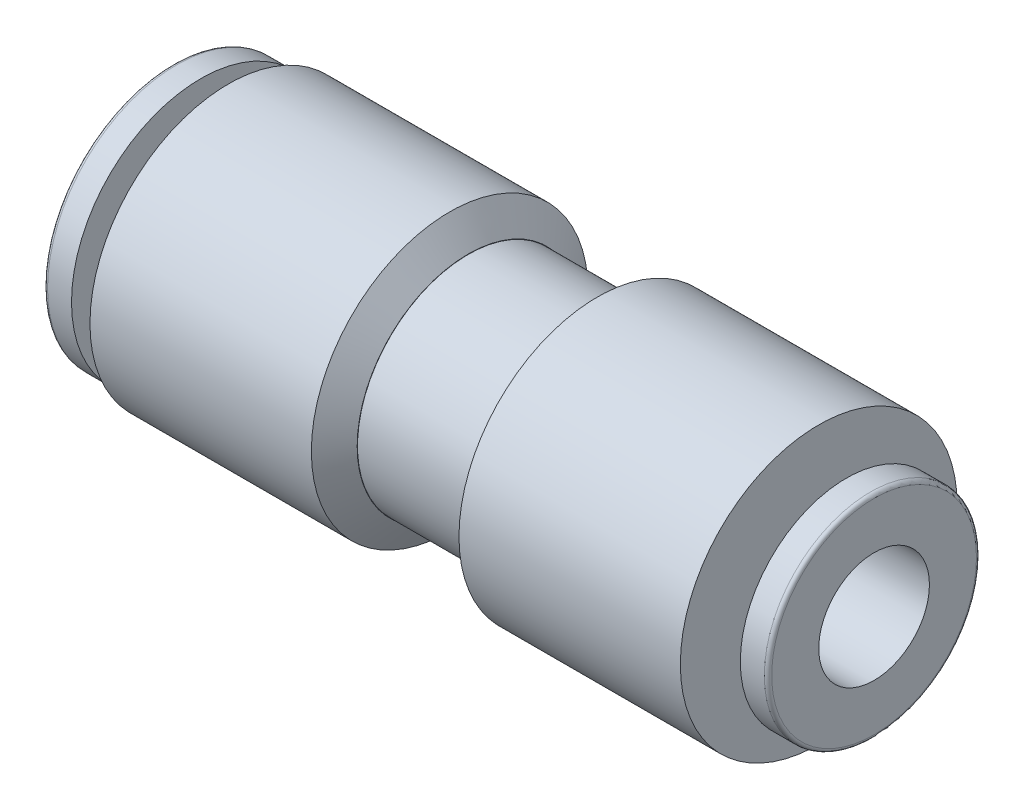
ISO-10303-21;
HEADER;
FILE_DESCRIPTION(('STEP AP214'),'2;1');
FILE_NAME('part.step','',(''),(''),'','','');
FILE_SCHEMA(('AUTOMOTIVE_DESIGN { 1 0 10303 214 1 1 1 1 }'));
ENDSEC;
DATA;
#1=APPLICATION_CONTEXT('core data for automotive mechanical design processes');
#2=APPLICATION_PROTOCOL_DEFINITION('international standard','automotive_design',2000,#1);
#3=PRODUCT_CONTEXT('',#1,'mechanical');
#4=PRODUCT('Part','Part','',(#3));
#5=PRODUCT_RELATED_PRODUCT_CATEGORY('part','',(#4));
#6=PRODUCT_DEFINITION_FORMATION('','',#4);
#7=PRODUCT_DEFINITION_CONTEXT('part definition',#1,'design');
#8=PRODUCT_DEFINITION('design','',#6,#7);
#9=PRODUCT_DEFINITION_SHAPE('','',#8);
#10=(LENGTH_UNIT() NAMED_UNIT(*) SI_UNIT(.MILLI.,.METRE.));
#11=(NAMED_UNIT(*) PLANE_ANGLE_UNIT() SI_UNIT($,.RADIAN.));
#12=(NAMED_UNIT(*) SI_UNIT($,.STERADIAN.) SOLID_ANGLE_UNIT());
#13=UNCERTAINTY_MEASURE_WITH_UNIT(LENGTH_MEASURE(1.E-05),#10,'distance_accuracy_value','');
#14=(GEOMETRIC_REPRESENTATION_CONTEXT(3) GLOBAL_UNCERTAINTY_ASSIGNED_CONTEXT((#13)) GLOBAL_UNIT_ASSIGNED_CONTEXT((#10,
#11,#12)) REPRESENTATION_CONTEXT('',''));
#15=CARTESIAN_POINT('',(0.,0.,0.));
#16=DIRECTION('',(0.,0.,1.));
#17=DIRECTION('',(1.,0.,0.));
#18=AXIS2_PLACEMENT_3D('',#15,#16,#17);
#19=CARTESIAN_POINT('',(0.,0.,0.));
#20=DIRECTION('',(1.,0.,0.));
#21=DIRECTION('',(0.,0.,-1.));
#22=AXIS2_PLACEMENT_3D('',#19,#20,#21);
#23=PLANE('',#22);
#24=CARTESIAN_POINT('',(0.,0.,0.));
#25=DIRECTION('',(1.,0.,0.));
#26=DIRECTION('',(0.,0.,-1.));
#27=AXIS2_PLACEMENT_3D('',#24,#25,#26);
#28=CIRCLE('',#27,7.5);
#29=CARTESIAN_POINT('',(0.,0.,7.5));
#30=VERTEX_POINT('',#29);
#31=EDGE_CURVE('E64',#30,#30,#28,.T.);
#32=ORIENTED_EDGE('',*,*,#31,.F.);
#33=EDGE_LOOP('',(#32));
#34=FACE_BOUND('',#33,.T.);
#35=CARTESIAN_POINT('',(0.,0.,0.));
#36=DIRECTION('',(1.,0.,0.));
#37=DIRECTION('',(0.,0.,-1.));
#38=AXIS2_PLACEMENT_3D('',#35,#36,#37);
#39=CIRCLE('',#38,4.5);
#40=CARTESIAN_POINT('',(0.,0.,-4.5));
#41=VERTEX_POINT('',#40);
#42=EDGE_CURVE('E61',#41,#41,#39,.F.);
#43=ORIENTED_EDGE('',*,*,#42,.F.);
#44=EDGE_LOOP('',(#43));
#45=FACE_BOUND('',#44,.T.);
#46=ADVANCED_FACE('F29',(#34,#45),#23,.F.);
#47=CARTESIAN_POINT('',(32.,0.,0.));
#48=DIRECTION('',(1.,0.,0.));
#49=DIRECTION('',(0.,0.,-1.));
#50=AXIS2_PLACEMENT_3D('',#47,#48,#49);
#51=PLANE('',#50);
#52=CARTESIAN_POINT('',(32.,0.,0.));
#53=DIRECTION('',(1.,0.,0.));
#54=DIRECTION('',(0.,0.,-1.));
#55=AXIS2_PLACEMENT_3D('',#52,#53,#54);
#56=CIRCLE('',#55,7.5);
#57=CARTESIAN_POINT('',(32.,0.,7.5));
#58=VERTEX_POINT('',#57);
#59=EDGE_CURVE('E71',#58,#58,#56,.T.);
#60=ORIENTED_EDGE('',*,*,#59,.T.);
#61=EDGE_LOOP('',(#60));
#62=FACE_BOUND('',#61,.T.);
#63=CARTESIAN_POINT('',(32.,0.,0.));
#64=DIRECTION('',(1.,0.,0.));
#65=DIRECTION('',(0.,0.,-1.));
#66=AXIS2_PLACEMENT_3D('',#63,#64,#65);
#67=CIRCLE('',#66,3.5);
#68=CARTESIAN_POINT('',(32.,0.,-3.5));
#69=VERTEX_POINT('',#68);
#70=EDGE_CURVE('E77',#69,#69,#67,.T.);
#71=ORIENTED_EDGE('',*,*,#70,.F.);
#72=EDGE_LOOP('',(#71));
#73=FACE_BOUND('',#72,.T.);
#74=ADVANCED_FACE('F129',(#62,#73),#51,.T.);
#75=CARTESIAN_POINT('',(13.,0.,0.));
#76=DIRECTION('',(1.,0.,0.));
#77=DIRECTION('',(0.,0.,-1.));
#78=AXIS2_PLACEMENT_3D('',#75,#76,#77);
#79=PLANE('',#78);
#80=CARTESIAN_POINT('',(13.,0.,0.));
#81=DIRECTION('',(1.,0.,0.));
#82=DIRECTION('',(0.,0.,-1.));
#83=AXIS2_PLACEMENT_3D('',#80,#81,#82);
#84=CIRCLE('',#83,6.01743903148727);
#85=CARTESIAN_POINT('',(13.,0.,-6.01743903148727));
#86=VERTEX_POINT('',#85);
#87=EDGE_CURVE('E58',#86,#86,#84,.T.);
#88=ORIENTED_EDGE('',*,*,#87,.T.);
#89=EDGE_LOOP('',(#88));
#90=FACE_BOUND('',#89,.T.);
#91=CARTESIAN_POINT('',(13.,0.,0.));
#92=DIRECTION('',(1.,0.,0.));
#93=DIRECTION('',(0.,0.,-1.));
#94=AXIS2_PLACEMENT_3D('',#91,#92,#93);
#95=CIRCLE('',#94,6.);
#96=CARTESIAN_POINT('',(13.,0.,-6.));
#97=VERTEX_POINT('',#96);
#98=EDGE_CURVE('E68',#97,#97,#95,.T.);
#99=ORIENTED_EDGE('',*,*,#98,.F.);
#100=EDGE_LOOP('',(#99));
#101=FACE_BOUND('',#100,.T.);
#102=ADVANCED_FACE('F135',(#90,#101),#79,.T.);
#103=CARTESIAN_POINT('',(13.,0.,0.));
#104=DIRECTION('',(-1.,0.,0.));
#105=DIRECTION('',(0.,0.,1.));
#106=AXIS2_PLACEMENT_3D('',#103,#104,#105);
#107=CYLINDRICAL_SURFACE('',#106,7.5);
#108=CARTESIAN_POINT('',(12.,0.,0.));
#109=DIRECTION('',(1.,0.,0.));
#110=DIRECTION('',(0.,0.,-1.));
#111=AXIS2_PLACEMENT_3D('',#108,#109,#110);
#112=CIRCLE('',#111,7.5);
#113=CARTESIAN_POINT('',(12.,0.,7.5));
#114=VERTEX_POINT('',#113);
#115=EDGE_CURVE('E55',#114,#114,#112,.F.);
#116=CARTESIAN_POINT('',(12.,0.,7.5));
#117=CARTESIAN_POINT('',(11.875,0.,7.5));
#118=CARTESIAN_POINT('',(11.75,0.,7.5));
#119=CARTESIAN_POINT('',(11.5,0.,7.5));
#120=CARTESIAN_POINT('',(11.375,0.,7.5));
#121=CARTESIAN_POINT('',(11.125,0.,7.5));
#122=CARTESIAN_POINT('',(11.,0.,7.5));
#123=CARTESIAN_POINT('',(10.75,0.,7.5));
#124=CARTESIAN_POINT('',(10.625,0.,7.5));
#125=CARTESIAN_POINT('',(10.375,0.,7.5));
#126=CARTESIAN_POINT('',(10.25,0.,7.5));
#127=CARTESIAN_POINT('',(10.,0.,7.5));
#128=CARTESIAN_POINT('',(9.875,0.,7.5));
#129=CARTESIAN_POINT('',(9.625,0.,7.5));
#130=CARTESIAN_POINT('',(9.5,0.,7.5));
#131=CARTESIAN_POINT('',(9.25,0.,7.5));
#132=CARTESIAN_POINT('',(9.12500000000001,0.,7.5));
#133=CARTESIAN_POINT('',(8.875,0.,7.5));
#134=CARTESIAN_POINT('',(8.75,0.,7.5));
#135=CARTESIAN_POINT('',(8.5,0.,7.5));
#136=CARTESIAN_POINT('',(8.375,0.,7.5));
#137=CARTESIAN_POINT('',(8.125,0.,7.5));
#138=CARTESIAN_POINT('',(8.,0.,7.5));
#139=CARTESIAN_POINT('',(7.75,0.,7.5));
#140=CARTESIAN_POINT('',(7.625,0.,7.5));
#141=CARTESIAN_POINT('',(7.375,0.,7.5));
#142=CARTESIAN_POINT('',(7.25,0.,7.5));
#143=CARTESIAN_POINT('',(7.,0.,7.5));
#144=CARTESIAN_POINT('',(6.875,0.,7.5));
#145=CARTESIAN_POINT('',(6.625,0.,7.5));
#146=CARTESIAN_POINT('',(6.5,0.,7.5));
#147=CARTESIAN_POINT('',(6.25,0.,7.5));
#148=CARTESIAN_POINT('',(6.125,0.,7.5));
#149=CARTESIAN_POINT('',(5.875,0.,7.5));
#150=CARTESIAN_POINT('',(5.75,0.,7.5));
#151=CARTESIAN_POINT('',(5.5,0.,7.5));
#152=CARTESIAN_POINT('',(5.375,0.,7.5));
#153=CARTESIAN_POINT('',(5.125,0.,7.5));
#154=CARTESIAN_POINT('',(5.,0.,7.5));
#155=CARTESIAN_POINT('',(4.75,0.,7.5));
#156=CARTESIAN_POINT('',(4.625,0.,7.5));
#157=CARTESIAN_POINT('',(4.375,0.,7.5));
#158=CARTESIAN_POINT('',(4.25,0.,7.5));
#159=CARTESIAN_POINT('',(4.,0.,7.5));
#160=CARTESIAN_POINT('',(3.875,0.,7.5));
#161=CARTESIAN_POINT('',(3.625,0.,7.5));
#162=CARTESIAN_POINT('',(3.5,0.,7.5));
#163=CARTESIAN_POINT('',(3.25,0.,7.5));
#164=CARTESIAN_POINT('',(3.125,0.,7.5));
#165=CARTESIAN_POINT('',(2.875,0.,7.5));
#166=CARTESIAN_POINT('',(2.75,0.,7.5));
#167=CARTESIAN_POINT('',(2.5,0.,7.5));
#168=CARTESIAN_POINT('',(2.375,0.,7.5));
#169=CARTESIAN_POINT('',(2.125,0.,7.5));
#170=CARTESIAN_POINT('',(2.,0.,7.5));
#171=CARTESIAN_POINT('',(1.75,0.,7.5));
#172=CARTESIAN_POINT('',(1.625,0.,7.5));
#173=CARTESIAN_POINT('',(1.375,0.,7.5));
#174=CARTESIAN_POINT('',(1.25,0.,7.5));
#175=CARTESIAN_POINT('',(1.,0.,7.5));
#176=CARTESIAN_POINT('',(0.875000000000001,0.,7.5));
#177=CARTESIAN_POINT('',(0.625000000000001,0.,7.5));
#178=CARTESIAN_POINT('',(0.5,0.,7.5));
#179=CARTESIAN_POINT('',(0.25,0.,7.5));
#180=CARTESIAN_POINT('',(0.125,0.,7.5));
#181=CARTESIAN_POINT('',(0.,0.,7.5));
#182=B_SPLINE_CURVE_WITH_KNOTS('',3,(#116,#117,#118,#119,#120,#121,#122,#123,#124,#125,#126,
#127,#128,#129,#130,#131,#132,#133,#134,#135,#136,#137,#138,#139,#140,#141,#142,#143,#144,#145,
#146,#147,#148,#149,#150,#151,#152,#153,#154,#155,#156,#157,#158,#159,#160,#161,#162,#163,#164,
#165,#166,#167,#168,#169,#170,#171,#172,#173,#174,#175,#176,#177,#178,#179,#180,#181),
.UNSPECIFIED.,.F.,.F.,(4,2,2,2,2,2,2,2,2,2,2,2,2,2,2,2,2,2,2,2,2,2,2,2,2,2,2,2,2,2,2,2,4),(0.,
0.375,0.750000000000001,1.125,1.5,1.875,2.25,2.625,3.,3.375,3.75,4.125,4.5,4.875,5.25,5.625,6.,
6.375,6.75,7.125,7.50000000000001,7.87500000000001,8.25000000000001,8.62500000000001,9.,9.375,
9.75,10.125,10.5,10.875,11.25,11.625,12.),.UNSPECIFIED.);
#183=EDGE_CURVE('BSEAM143',#114,#30,#182,.T.);
#184=ORIENTED_EDGE('',*,*,#115,.T.);
#185=ORIENTED_EDGE('',*,*,#31,.T.);
#186=ORIENTED_EDGE('',*,*,#183,.T.);
#187=ORIENTED_EDGE('',*,*,#183,.F.);
#188=EDGE_LOOP('',(#184,#186,#185,#187));
#189=FACE_BOUND('',#188,.T.);
#190=ADVANCED_FACE('F143',(#189),#107,.T.);
#191=CARTESIAN_POINT('',(19.,0.,0.));
#192=DIRECTION('',(-1.,0.,0.));
#193=DIRECTION('',(0.,0.,1.));
#194=AXIS2_PLACEMENT_3D('',#191,#192,#193);
#195=CYLINDRICAL_SURFACE('',#194,6.);
#196=CARTESIAN_POINT('',(19.,0.,0.));
#197=DIRECTION('',(1.,0.,0.));
#198=DIRECTION('',(0.,0.,-1.));
#199=AXIS2_PLACEMENT_3D('',#196,#197,#198);
#200=CIRCLE('',#199,6.);
#201=CARTESIAN_POINT('',(19.,0.,-6.));
#202=VERTEX_POINT('',#201);
#203=EDGE_CURVE('E67',#202,#202,#200,.T.);
#204=ORIENTED_EDGE('',*,*,#203,.F.);
#205=EDGE_LOOP('',(#204));
#206=FACE_BOUND('',#205,.T.);
#207=ORIENTED_EDGE('',*,*,#98,.T.);
#208=EDGE_LOOP('',(#207));
#209=FACE_BOUND('',#208,.T.);
#210=ADVANCED_FACE('F146',(#206,#209),#195,.T.);
#211=CARTESIAN_POINT('',(19.,0.,0.));
#212=DIRECTION('',(1.,0.,0.));
#213=DIRECTION('',(0.,0.,-1.));
#214=AXIS2_PLACEMENT_3D('',#211,#212,#213);
#215=PLANE('',#214);
#216=CARTESIAN_POINT('',(19.,0.,0.));
#217=DIRECTION('',(1.,0.,0.));
#218=DIRECTION('',(0.,0.,-1.));
#219=AXIS2_PLACEMENT_3D('',#216,#217,#218);
#220=CIRCLE('',#219,6.01743903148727);
#221=CARTESIAN_POINT('',(19.,0.,-6.01743903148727));
#222=VERTEX_POINT('',#221);
#223=EDGE_CURVE('E49',#222,#222,#220,.F.);
#224=ORIENTED_EDGE('',*,*,#223,.T.);
#225=EDGE_LOOP('',(#224));
#226=FACE_BOUND('',#225,.T.);
#227=ORIENTED_EDGE('',*,*,#203,.T.);
#228=EDGE_LOOP('',(#227));
#229=FACE_BOUND('',#228,.T.);
#230=ADVANCED_FACE('F191',(#226,#229),#215,.F.);
#231=CARTESIAN_POINT('',(32.,0.,0.));
#232=DIRECTION('',(-1.,0.,0.));
#233=DIRECTION('',(0.,0.,1.));
#234=AXIS2_PLACEMENT_3D('',#231,#232,#233);
#235=CYLINDRICAL_SURFACE('',#234,7.5);
#236=CARTESIAN_POINT('',(20.,0.,0.));
#237=DIRECTION('',(1.,0.,0.));
#238=DIRECTION('',(0.,0.,-1.));
#239=AXIS2_PLACEMENT_3D('',#236,#237,#238);
#240=CIRCLE('',#239,7.5);
#241=CARTESIAN_POINT('',(20.,0.,7.5));
#242=VERTEX_POINT('',#241);
#243=EDGE_CURVE('E52',#242,#242,#240,.T.);
#244=CARTESIAN_POINT('',(20.,0.,7.5));
#245=CARTESIAN_POINT('',(20.125,0.,7.5));
#246=CARTESIAN_POINT('',(20.25,0.,7.5));
#247=CARTESIAN_POINT('',(20.5,0.,7.5));
#248=CARTESIAN_POINT('',(20.625,0.,7.5));
#249=CARTESIAN_POINT('',(20.875,0.,7.5));
#250=CARTESIAN_POINT('',(21.,0.,7.5));
#251=CARTESIAN_POINT('',(21.25,0.,7.5));
#252=CARTESIAN_POINT('',(21.375,0.,7.5));
#253=CARTESIAN_POINT('',(21.625,0.,7.5));
#254=CARTESIAN_POINT('',(21.75,0.,7.5));
#255=CARTESIAN_POINT('',(22.,0.,7.5));
#256=CARTESIAN_POINT('',(22.125,0.,7.5));
#257=CARTESIAN_POINT('',(22.375,0.,7.5));
#258=CARTESIAN_POINT('',(22.5,0.,7.5));
#259=CARTESIAN_POINT('',(22.75,0.,7.5));
#260=CARTESIAN_POINT('',(22.875,0.,7.5));
#261=CARTESIAN_POINT('',(23.125,0.,7.5));
#262=CARTESIAN_POINT('',(23.25,0.,7.5));
#263=CARTESIAN_POINT('',(23.5,0.,7.5));
#264=CARTESIAN_POINT('',(23.625,0.,7.5));
#265=CARTESIAN_POINT('',(23.875,0.,7.5));
#266=CARTESIAN_POINT('',(24.,0.,7.5));
#267=CARTESIAN_POINT('',(24.25,0.,7.5));
#268=CARTESIAN_POINT('',(24.375,0.,7.5));
#269=CARTESIAN_POINT('',(24.625,0.,7.5));
#270=CARTESIAN_POINT('',(24.75,0.,7.5));
#271=CARTESIAN_POINT('',(25.,0.,7.5));
#272=CARTESIAN_POINT('',(25.125,0.,7.5));
#273=CARTESIAN_POINT('',(25.375,0.,7.5));
#274=CARTESIAN_POINT('',(25.5,0.,7.5));
#275=CARTESIAN_POINT('',(25.75,0.,7.5));
#276=CARTESIAN_POINT('',(25.875,0.,7.5));
#277=CARTESIAN_POINT('',(26.125,0.,7.5));
#278=CARTESIAN_POINT('',(26.25,0.,7.5));
#279=CARTESIAN_POINT('',(26.5,0.,7.5));
#280=CARTESIAN_POINT('',(26.625,0.,7.5));
#281=CARTESIAN_POINT('',(26.875,0.,7.5));
#282=CARTESIAN_POINT('',(27.,0.,7.5));
#283=CARTESIAN_POINT('',(27.25,0.,7.5));
#284=CARTESIAN_POINT('',(27.375,0.,7.5));
#285=CARTESIAN_POINT('',(27.625,0.,7.5));
#286=CARTESIAN_POINT('',(27.75,0.,7.5));
#287=CARTESIAN_POINT('',(28.,0.,7.5));
#288=CARTESIAN_POINT('',(28.125,0.,7.5));
#289=CARTESIAN_POINT('',(28.375,0.,7.5));
#290=CARTESIAN_POINT('',(28.5,0.,7.5));
#291=CARTESIAN_POINT('',(28.75,0.,7.5));
#292=CARTESIAN_POINT('',(28.875,0.,7.5));
#293=CARTESIAN_POINT('',(29.125,0.,7.5));
#294=CARTESIAN_POINT('',(29.25,0.,7.5));
#295=CARTESIAN_POINT('',(29.5,0.,7.5));
#296=CARTESIAN_POINT('',(29.625,0.,7.5));
#297=CARTESIAN_POINT('',(29.875,0.,7.5));
#298=CARTESIAN_POINT('',(30.,0.,7.5));
#299=CARTESIAN_POINT('',(30.25,0.,7.5));
#300=CARTESIAN_POINT('',(30.375,0.,7.5));
#301=CARTESIAN_POINT('',(30.625,0.,7.5));
#302=CARTESIAN_POINT('',(30.75,0.,7.5));
#303=CARTESIAN_POINT('',(31.,0.,7.5));
#304=CARTESIAN_POINT('',(31.125,0.,7.5));
#305=CARTESIAN_POINT('',(31.375,0.,7.5));
#306=CARTESIAN_POINT('',(31.5,0.,7.5));
#307=CARTESIAN_POINT('',(31.75,0.,7.5));
#308=CARTESIAN_POINT('',(31.875,0.,7.5));
#309=CARTESIAN_POINT('',(32.,0.,7.5));
#310=B_SPLINE_CURVE_WITH_KNOTS('',3,(#244,#245,#246,#247,#248,#249,#250,#251,#252,#253,#254,
#255,#256,#257,#258,#259,#260,#261,#262,#263,#264,#265,#266,#267,#268,#269,#270,#271,#272,#273,
#274,#275,#276,#277,#278,#279,#280,#281,#282,#283,#284,#285,#286,#287,#288,#289,#290,#291,#292,
#293,#294,#295,#296,#297,#298,#299,#300,#301,#302,#303,#304,#305,#306,#307,#308,#309),
.UNSPECIFIED.,.F.,.F.,(4,2,2,2,2,2,2,2,2,2,2,2,2,2,2,2,2,2,2,2,2,2,2,2,2,2,2,2,2,2,2,2,4),(0.,
0.375,0.750000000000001,1.125,1.5,1.875,2.25,2.625,3.,3.375,3.75,4.125,4.5,4.875,5.25,5.625,6.,
6.375,6.75,7.125,7.5,7.875,8.25,8.625,9.00000000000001,9.37500000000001,9.75000000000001,10.125,
10.5,10.875,11.25,11.625,12.),.UNSPECIFIED.);
#311=EDGE_CURVE('BSEAM188',#242,#58,#310,.T.);
#312=ORIENTED_EDGE('',*,*,#243,.T.);
#313=ORIENTED_EDGE('',*,*,#59,.F.);
#314=ORIENTED_EDGE('',*,*,#311,.T.);
#315=ORIENTED_EDGE('',*,*,#311,.F.);
#316=EDGE_LOOP('',(#312,#314,#313,#315));
#317=FACE_BOUND('',#316,.T.);
#318=ADVANCED_FACE('F188',(#317),#235,.T.);
#319=CARTESIAN_POINT('',(33.5,0.,0.));
#320=DIRECTION('',(-1.,0.,0.));
#321=DIRECTION('',(0.,0.,1.));
#322=AXIS2_PLACEMENT_3D('',#319,#320,#321);
#323=CYLINDRICAL_SURFACE('',#322,3.5);
#324=CARTESIAN_POINT('',(33.5,0.,0.));
#325=DIRECTION('',(1.,0.,0.));
#326=DIRECTION('',(0.,0.,-1.));
#327=AXIS2_PLACEMENT_3D('',#324,#325,#326);
#328=CIRCLE('',#327,3.5);
#329=CARTESIAN_POINT('',(33.5,0.,-3.5));
#330=VERTEX_POINT('',#329);
#331=EDGE_CURVE('E76',#330,#330,#328,.T.);
#332=ORIENTED_EDGE('',*,*,#331,.F.);
#333=EDGE_LOOP('',(#332));
#334=FACE_BOUND('',#333,.T.);
#335=ORIENTED_EDGE('',*,*,#70,.T.);
#336=EDGE_LOOP('',(#335));
#337=FACE_BOUND('',#336,.T.);
#338=ADVANCED_FACE('F184',(#334,#337),#323,.T.);
#339=CARTESIAN_POINT('',(33.5,0.,0.));
#340=DIRECTION('',(1.,0.,0.));
#341=DIRECTION('',(0.,0.,-1.));
#342=AXIS2_PLACEMENT_3D('',#339,#340,#341);
#343=PLANE('',#342);
#344=CARTESIAN_POINT('',(33.5,0.,0.));
#345=DIRECTION('',(1.,0.,0.));
#346=DIRECTION('',(0.,0.,-1.));
#347=AXIS2_PLACEMENT_3D('',#344,#345,#346);
#348=CIRCLE('',#347,5.75);
#349=CARTESIAN_POINT('',(33.5,0.,-5.75));
#350=VERTEX_POINT('',#349);
#351=EDGE_CURVE('E80',#350,#350,#348,.T.);
#352=ORIENTED_EDGE('',*,*,#351,.F.);
#353=EDGE_LOOP('',(#352));
#354=FACE_BOUND('',#353,.T.);
#355=ORIENTED_EDGE('',*,*,#331,.T.);
#356=EDGE_LOOP('',(#355));
#357=FACE_BOUND('',#356,.T.);
#358=ADVANCED_FACE('F179',(#354,#357),#343,.F.);
#359=CARTESIAN_POINT('',(35.,0.,0.));
#360=DIRECTION('',(-1.,0.,0.));
#361=DIRECTION('',(0.,0.,1.));
#362=AXIS2_PLACEMENT_3D('',#359,#360,#361);
#363=CYLINDRICAL_SURFACE('',#362,5.75);
#364=CARTESIAN_POINT('',(34.8,0.,0.));
#365=DIRECTION('',(1.,0.,0.));
#366=DIRECTION('',(0.,0.,-1.));
#367=AXIS2_PLACEMENT_3D('',#364,#365,#366);
#368=CIRCLE('',#367,5.75);
#369=CARTESIAN_POINT('',(34.8,0.,-5.75));
#370=VERTEX_POINT('',#369);
#371=EDGE_CURVE('E40',#370,#370,#368,.F.);
#372=ORIENTED_EDGE('',*,*,#371,.T.);
#373=EDGE_LOOP('',(#372));
#374=FACE_BOUND('',#373,.T.);
#375=ORIENTED_EDGE('',*,*,#351,.T.);
#376=EDGE_LOOP('',(#375));
#377=FACE_BOUND('',#376,.T.);
#378=ADVANCED_FACE('F169',(#374,#377),#363,.T.);
#379=CARTESIAN_POINT('',(35.,0.,0.));
#380=DIRECTION('',(1.,0.,0.));
#381=DIRECTION('',(0.,0.,-1.));
#382=AXIS2_PLACEMENT_3D('',#379,#380,#381);
#383=PLANE('',#382);
#384=CARTESIAN_POINT('',(35.,0.,0.));
#385=DIRECTION('',(1.,0.,0.));
#386=DIRECTION('',(0.,0.,-1.));
#387=AXIS2_PLACEMENT_3D('',#384,#385,#386);
#388=CIRCLE('',#387,5.55);
#389=CARTESIAN_POINT('',(35.,0.,-5.55));
#390=VERTEX_POINT('',#389);
#391=EDGE_CURVE('E44',#390,#390,#388,.T.);
#392=ORIENTED_EDGE('',*,*,#391,.T.);
#393=EDGE_LOOP('',(#392));
#394=FACE_BOUND('',#393,.T.);
#395=CARTESIAN_POINT('',(35.,0.,0.));
#396=DIRECTION('',(1.,0.,0.));
#397=DIRECTION('',(0.,0.,-1.));
#398=AXIS2_PLACEMENT_3D('',#395,#396,#397);
#399=CIRCLE('',#398,3.);
#400=CARTESIAN_POINT('',(35.,0.,-3.));
#401=VERTEX_POINT('',#400);
#402=EDGE_CURVE('E91',#401,#401,#399,.T.);
#403=ORIENTED_EDGE('',*,*,#402,.F.);
#404=EDGE_LOOP('',(#403));
#405=FACE_BOUND('',#404,.T.);
#406=ADVANCED_FACE('F165',(#394,#405),#383,.T.);
#407=CARTESIAN_POINT('',(-1.5,0.,0.));
#408=DIRECTION('',(1.,0.,0.));
#409=DIRECTION('',(0.,0.,-1.));
#410=AXIS2_PLACEMENT_3D('',#407,#408,#409);
#411=CYLINDRICAL_SURFACE('',#410,4.5);
#412=CARTESIAN_POINT('',(-1.5,0.,0.));
#413=DIRECTION('',(-1.,0.,0.));
#414=DIRECTION('',(0.,0.,1.));
#415=AXIS2_PLACEMENT_3D('',#412,#413,#414);
#416=CIRCLE('',#415,4.5);
#417=CARTESIAN_POINT('',(-1.5,0.,4.5));
#418=VERTEX_POINT('',#417);
#419=EDGE_CURVE('E85',#418,#418,#416,.T.);
#420=ORIENTED_EDGE('',*,*,#419,.F.);
#421=EDGE_LOOP('',(#420));
#422=FACE_BOUND('',#421,.T.);
#423=ORIENTED_EDGE('',*,*,#42,.T.);
#424=EDGE_LOOP('',(#423));
#425=FACE_BOUND('',#424,.T.);
#426=ADVANCED_FACE('F168',(#422,#425),#411,.T.);
#427=CARTESIAN_POINT('',(-1.5,0.,0.));
#428=DIRECTION('',(-1.,0.,0.));
#429=DIRECTION('',(0.,0.,1.));
#430=AXIS2_PLACEMENT_3D('',#427,#428,#429);
#431=PLANE('',#430);
#432=CARTESIAN_POINT('',(-1.5,0.,0.));
#433=DIRECTION('',(-1.,0.,0.));
#434=DIRECTION('',(0.,0.,1.));
#435=AXIS2_PLACEMENT_3D('',#432,#433,#434);
#436=CIRCLE('',#435,7.);
#437=CARTESIAN_POINT('',(-1.5,0.,7.));
#438=VERTEX_POINT('',#437);
#439=EDGE_CURVE('E88',#438,#438,#436,.T.);
#440=ORIENTED_EDGE('',*,*,#439,.F.);
#441=EDGE_LOOP('',(#440));
#442=FACE_BOUND('',#441,.T.);
#443=ORIENTED_EDGE('',*,*,#419,.T.);
#444=EDGE_LOOP('',(#443));
#445=FACE_BOUND('',#444,.T.);
#446=ADVANCED_FACE('F125',(#442,#445),#431,.F.);
#447=CARTESIAN_POINT('',(-3.,0.,0.));
#448=DIRECTION('',(1.,0.,0.));
#449=DIRECTION('',(0.,0.,-1.));
#450=AXIS2_PLACEMENT_3D('',#447,#448,#449);
#451=CYLINDRICAL_SURFACE('',#450,7.);
#452=CARTESIAN_POINT('',(-2.8,0.,0.));
#453=DIRECTION('',(-1.,0.,0.));
#454=DIRECTION('',(0.,0.,1.));
#455=AXIS2_PLACEMENT_3D('',#452,#453,#454);
#456=CIRCLE('',#455,7.);
#457=CARTESIAN_POINT('',(-2.8,0.,7.));
#458=VERTEX_POINT('',#457);
#459=EDGE_CURVE('E10',#458,#458,#456,.F.);
#460=ORIENTED_EDGE('',*,*,#459,.T.);
#461=EDGE_LOOP('',(#460));
#462=FACE_BOUND('',#461,.T.);
#463=ORIENTED_EDGE('',*,*,#439,.T.);
#464=EDGE_LOOP('',(#463));
#465=FACE_BOUND('',#464,.T.);
#466=ADVANCED_FACE('F117',(#462,#465),#451,.T.);
#467=CARTESIAN_POINT('',(-3.,0.,0.));
#468=DIRECTION('',(-1.,0.,0.));
#469=DIRECTION('',(0.,0.,1.));
#470=AXIS2_PLACEMENT_3D('',#467,#468,#469);
#471=PLANE('',#470);
#472=CARTESIAN_POINT('',(-3.,0.,0.));
#473=DIRECTION('',(-1.,0.,0.));
#474=DIRECTION('',(0.,0.,1.));
#475=AXIS2_PLACEMENT_3D('',#472,#473,#474);
#476=CIRCLE('',#475,6.8);
#477=CARTESIAN_POINT('',(-3.,0.,6.8));
#478=VERTEX_POINT('',#477);
#479=EDGE_CURVE('E36',#478,#478,#476,.T.);
#480=ORIENTED_EDGE('',*,*,#479,.T.);
#481=EDGE_LOOP('',(#480));
#482=FACE_BOUND('',#481,.T.);
#483=CARTESIAN_POINT('',(-3.,0.,0.));
#484=DIRECTION('',(-1.,0.,0.));
#485=DIRECTION('',(0.,0.,1.));
#486=AXIS2_PLACEMENT_3D('',#483,#484,#485);
#487=CIRCLE('',#486,4.);
#488=CARTESIAN_POINT('',(-3.,0.,4.));
#489=VERTEX_POINT('',#488);
#490=EDGE_CURVE('E98',#489,#489,#487,.T.);
#491=ORIENTED_EDGE('',*,*,#490,.F.);
#492=EDGE_LOOP('',(#491));
#493=FACE_BOUND('',#492,.T.);
#494=ADVANCED_FACE('F114',(#482,#493),#471,.T.);
#495=CARTESIAN_POINT('',(16.,0.,0.));
#496=DIRECTION('',(1.,0.,0.));
#497=DIRECTION('',(0.,0.,-1.));
#498=AXIS2_PLACEMENT_3D('',#495,#496,#497);
#499=CYLINDRICAL_SURFACE('',#498,3.);
#500=CARTESIAN_POINT('',(16.,0.,0.));
#501=DIRECTION('',(-1.,0.,0.));
#502=DIRECTION('',(0.,0.,1.));
#503=AXIS2_PLACEMENT_3D('',#500,#501,#502);
#504=CIRCLE('',#503,3.);
#505=CARTESIAN_POINT('',(16.,0.,3.));
#506=VERTEX_POINT('',#505);
#507=EDGE_CURVE('E94',#506,#506,#504,.F.);
#508=ORIENTED_EDGE('',*,*,#507,.F.);
#509=EDGE_LOOP('',(#508));
#510=FACE_BOUND('',#509,.T.);
#511=ORIENTED_EDGE('',*,*,#402,.T.);
#512=EDGE_LOOP('',(#511));
#513=FACE_BOUND('',#512,.T.);
#514=ADVANCED_FACE('F116',(#510,#513),#499,.F.);
#515=CARTESIAN_POINT('',(16.,0.,0.));
#516=DIRECTION('',(-1.,0.,0.));
#517=DIRECTION('',(0.,0.,1.));
#518=AXIS2_PLACEMENT_3D('',#515,#516,#517);
#519=PLANE('',#518);
#520=CARTESIAN_POINT('',(16.,0.,0.));
#521=DIRECTION('',(-1.,0.,0.));
#522=DIRECTION('',(0.,0.,1.));
#523=AXIS2_PLACEMENT_3D('',#520,#521,#522);
#524=CIRCLE('',#523,4.);
#525=CARTESIAN_POINT('',(16.,0.,4.));
#526=VERTEX_POINT('',#525);
#527=EDGE_CURVE('E97',#526,#526,#524,.T.);
#528=ORIENTED_EDGE('',*,*,#527,.T.);
#529=EDGE_LOOP('',(#528));
#530=FACE_BOUND('',#529,.T.);
#531=ORIENTED_EDGE('',*,*,#507,.T.);
#532=EDGE_LOOP('',(#531));
#533=FACE_BOUND('',#532,.T.);
#534=ADVANCED_FACE('F104',(#530,#533),#519,.T.);
#535=CARTESIAN_POINT('',(16.,0.,0.));
#536=DIRECTION('',(-1.,0.,0.));
#537=DIRECTION('',(0.,0.,1.));
#538=AXIS2_PLACEMENT_3D('',#535,#536,#537);
#539=CYLINDRICAL_SURFACE('',#538,4.);
#540=ORIENTED_EDGE('',*,*,#527,.F.);
#541=EDGE_LOOP('',(#540));
#542=FACE_BOUND('',#541,.T.);
#543=ORIENTED_EDGE('',*,*,#490,.T.);
#544=EDGE_LOOP('',(#543));
#545=FACE_BOUND('',#544,.T.);
#546=ADVANCED_FACE('F107',(#542,#545),#539,.F.);
#547=CARTESIAN_POINT('',(13.,0.,0.));
#548=DIRECTION('',(-1.,0.,0.));
#549=DIRECTION('',(0.,0.,1.));
#550=AXIS2_PLACEMENT_3D('',#547,#548,#549);
#551=CONICAL_SURFACE('',#550,6.01743903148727,0.977384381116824);
#552=ORIENTED_EDGE('',*,*,#115,.F.);
#553=EDGE_LOOP('',(#552));
#554=FACE_BOUND('',#553,.T.);
#555=ORIENTED_EDGE('',*,*,#87,.F.);
#556=EDGE_LOOP('',(#555));
#557=FACE_BOUND('',#556,.T.);
#558=ADVANCED_FACE('F110',(#554,#557),#551,.T.);
#559=CARTESIAN_POINT('',(20.,0.,0.));
#560=DIRECTION('',(1.,0.,0.));
#561=DIRECTION('',(0.,0.,-1.));
#562=AXIS2_PLACEMENT_3D('',#559,#560,#561);
#563=CONICAL_SURFACE('',#562,7.5,0.977384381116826);
#564=ORIENTED_EDGE('',*,*,#223,.F.);
#565=EDGE_LOOP('',(#564));
#566=FACE_BOUND('',#565,.T.);
#567=ORIENTED_EDGE('',*,*,#243,.F.);
#568=EDGE_LOOP('',(#567));
#569=FACE_BOUND('',#568,.T.);
#570=ADVANCED_FACE('F150',(#566,#569),#563,.T.);
#571=CARTESIAN_POINT('',(34.8,0.,0.));
#572=DIRECTION('',(1.,0.,0.));
#573=DIRECTION('',(0.,0.,-1.));
#574=AXIS2_PLACEMENT_3D('',#571,#572,#573);
#575=TOROIDAL_SURFACE('',#574,5.55,0.2);
#576=ORIENTED_EDGE('',*,*,#371,.F.);
#577=EDGE_LOOP('',(#576));
#578=FACE_BOUND('',#577,.T.);
#579=ORIENTED_EDGE('',*,*,#391,.F.);
#580=EDGE_LOOP('',(#579));
#581=FACE_BOUND('',#580,.T.);
#582=ADVANCED_FACE('F153',(#578,#581),#575,.T.);
#583=CARTESIAN_POINT('',(-2.8,0.,0.));
#584=DIRECTION('',(-1.,0.,0.));
#585=DIRECTION('',(0.,0.,1.));
#586=AXIS2_PLACEMENT_3D('',#583,#584,#585);
#587=TOROIDAL_SURFACE('',#586,6.8,0.2);
#588=ORIENTED_EDGE('',*,*,#459,.F.);
#589=EDGE_LOOP('',(#588));
#590=FACE_BOUND('',#589,.T.);
#591=ORIENTED_EDGE('',*,*,#479,.F.);
#592=EDGE_LOOP('',(#591));
#593=FACE_BOUND('',#592,.T.);
#594=ADVANCED_FACE('F31',(#590,#593),#587,.T.);
#595=CLOSED_SHELL('',(#46,#74,#102,#190,#210,#230,#318,#338,#358,#378,#406,#426,#446,#466,#494,
#514,#534,#546,#558,#570,#582,#594));
#596=MANIFOLD_SOLID_BREP('B2',#595);
#597=ADVANCED_BREP_SHAPE_REPRESENTATION('',(#18,#596),#14);
#598=SHAPE_DEFINITION_REPRESENTATION(#9,#597);
ENDSEC;
END-ISO-10303-21;
